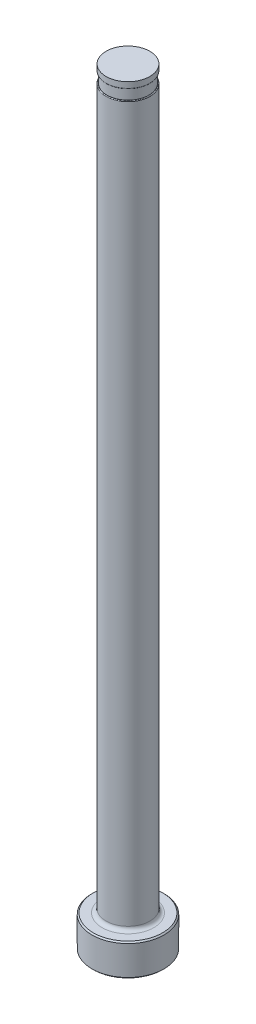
from build123d import *

# Parameters (mm, degrees)
CHAMFER1_SIZE     = 0.254
FILLET1_R         = 0.762
SKETCH2_W         = 0.2032
SKETCH2_H         = 2.032
D_SLOT_DEPTH      = 153.73390245
D_SLOT_DEPTH_BACK = 153.73390245
SKETCH5_W         = 0.01905
SKETCH5_H         = 1.27
FILLET2_R         = 0.127


with BuildPart() as part:
    # Sketch1 → Revolve1 (revolve)
    with BuildSketch(Plane.XY, mode=Mode.PRIVATE) as revolve1_sk:
        Polygon((0, 0), (-7.1374, 0), (-7.1374, 6.35), (-4.36499, 6.35), (-4.36499, 152.4), (0, 152.4), align=None)
    revolve(revolve1_sk.sketch.rotate(Axis((0, 259.958771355, 0), (0, -1, 0)), 270), axis=Axis((0, 259.958771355, 0), (0, -1, 0)))

    # Chamfer1
    chamfer1_edges = [part.edges().sort_by_distance(p)[0] for p in [
        (0, 6.35, -7.1374),
        (0, 0, -7.1374),
    ]]
    chamfer(chamfer1_edges, length=CHAMFER1_SIZE)

    # Fillet1
    fillet1_edges = [part.edges().sort_by_distance(p)[0] for p in [
        (0, 6.35, -4.36499),
    ]]
    fillet(fillet1_edges, radius=FILLET1_R)

    # Sketch2 → Vent Relief (revolve, cut)
    with BuildSketch(Plane.XY, mode=Mode.PRIVATE) as vent_relief_sk:
        with Locations((-4.26339, 150.114)):
            Rectangle(SKETCH2_W, SKETCH2_H)
    revolve(vent_relief_sk.sketch.rotate(Axis((0, 153.448281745, 0), (0, -1, 0)), 270), axis=Axis((0, 153.448281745, 0), (0, -1, 0)), mode=Mode.SUBTRACT)

    # Sketch3 → D-Slot (cut, two sides: drawn at the far end of the back side and taken through both)
    with BuildSketch(Plane.XY.offset(-D_SLOT_DEPTH_BACK)):
        with BuildLine():
            Line((-4.16179, 150.114), (-4.16179, 86.614))
            ThreePointArc((-4.16179, 86.614), (-4.213003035, 86.046038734), (-4.36499, 85.4964))
            Line((-4.36499, 85.4964), (-4.36499, 150.114))
            Line((-4.36499, 150.114), (-4.16179, 150.114))
        make_face()
    extrude(amount=D_SLOT_DEPTH + D_SLOT_DEPTH_BACK, mode=Mode.SUBTRACT)

    # Sketch5 → Vent Diameter (revolve, cut)
    with BuildSketch(Plane.XY, mode=Mode.PRIVATE) as vent_diameter_sk:
        with Locations((-4.355465, 151.765)):
            Rectangle(SKETCH5_W, SKETCH5_H)
    revolve(vent_diameter_sk.sketch.rotate(Axis((0, 152.687735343, 0), (0, -1, 0)), 90), axis=Axis((0, 152.687735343, 0), (0, -1, 0)), mode=Mode.SUBTRACT)

    # Fillet2
    fillet2_edges = [part.edges().sort_by_distance(p)[0] for p in [
        (3.521275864, 149.098, -2.579487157),
        (0, 151.13, 4.34594),
    ]]
    fillet(fillet2_edges, radius=FILLET2_R)


solid = part.part
